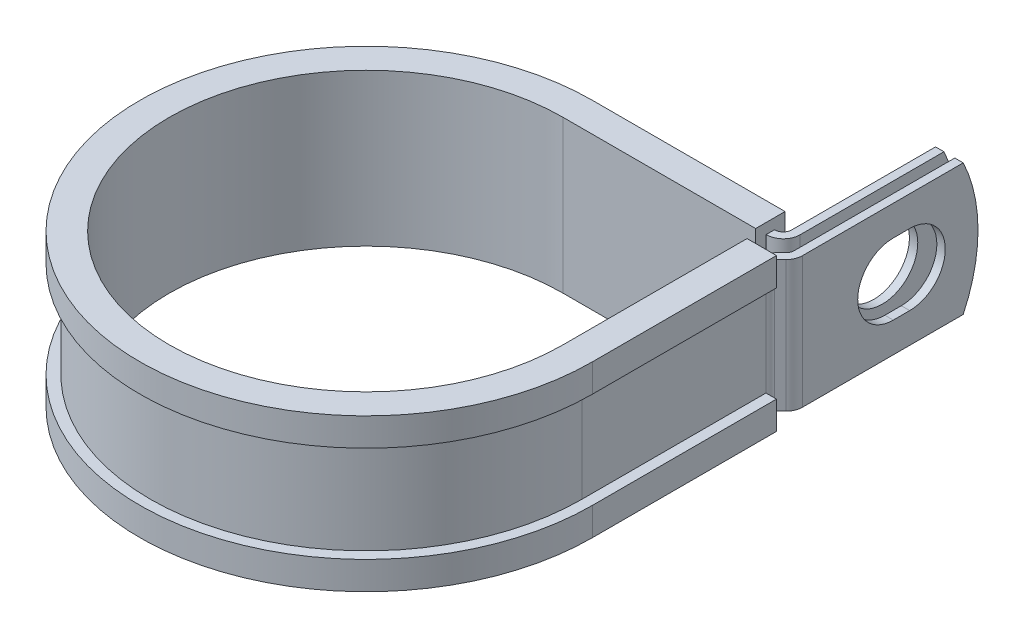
from build123d import *

# Parameters (mm, degrees)
EXTRUDE_THIN1_DEPTH = 9.525
SKETCH2_R           = 5.1562
CUT_EXTRUDE1_DEPTH  = 1.2192
CUT_EXTRUDE2_DEPTH  = 1.2192
CUT_EXTRUDE3_DEPTH  = 83.699802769


with BuildPart() as part:
    # Sketch1 → Extrude-Thin1 (new, symmetric)
    with BuildSketch(Plane(origin=(0, 0, 0), x_dir=(1, 0, 0), z_dir=(0, 1, 0))):
        with BuildLine():
            Line((31.9964698, 55.5498), (31.9964698, 30.099))
            ThreePointArc((31.9964698, 30.099), (31.903663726, 29.632432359), (31.639374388, 29.236895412))
            Line((31.639374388, 29.236895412), (30.813190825, 28.410711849))
            ThreePointArc((30.813190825, 28.410711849), (30.284612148, 27.619637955), (30.099, 26.686502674))
            Line((30.099, 26.686502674), (30.099, 0))
            ThreePointArc((30.099, 0), (-21.283207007, -21.283207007), (0, 30.099))
            Line((0, 30.099), (27.9832698, 30.099))
            ThreePointArc((27.9832698, 30.099), (29.707478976, 30.813190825), (30.4216698, 32.5374))
            Line((30.4216698, 32.5374), (30.4216698, 55.5498))
            Line((30.4216698, 55.5498), (29.2024698, 55.5498))
            Line((29.2024698, 55.5498), (29.2024698, 32.5374))
            ThreePointArc((29.2024698, 32.5374), (28.845374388, 31.675295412), (27.9832698, 31.3182))
            Line((27.9832698, 31.3182), (0, 31.3182))
            ThreePointArc((0, 31.3182), (-22.145311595, -22.145311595), (31.3182, 0))
            Line((31.3182, 0), (31.3182, 26.686502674))
            ThreePointArc((31.3182, 26.686502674), (31.411006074, 27.153070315), (31.675295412, 27.548607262))
            Line((31.675295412, 27.548607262), (32.501478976, 28.374790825))
            ThreePointArc((32.501478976, 28.374790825), (33.030057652, 29.165864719), (33.2156698, 30.099))
            Line((33.2156698, 30.099), (33.2156698, 55.5498))
            Line((33.2156698, 55.5498), (31.9964698, 55.5498))
        make_face()
    extrude(amount=EXTRUDE_THIN1_DEPTH, both=True)

    # Sketch2 → Cut-Extrude1 (cut)
    with BuildSketch(Plane.ZY.offset(-29.2024698)):
        with Locations((-44.45, 0)):
            Circle(SKETCH2_R)
    extrude(amount=-CUT_EXTRUDE1_DEPTH, mode=Mode.SUBTRACT)

    # Sketch3 → Cut-Extrude2 (cut)
    with BuildSketch(Plane(origin=(33.2156698, 0, 0), x_dir=(0, 0, -1), z_dir=(1, 0, 0))):
        with BuildLine():
            Line((43.2562, 5.1562), (45.6438, 5.1562))
            ThreePointArc((45.6438, 5.1562), (50.8, 0), (45.6438, -5.1562))
            Line((45.6438, -5.1562), (43.2562, -5.1562))
            ThreePointArc((43.2562, -5.1562), (38.1, 0), (43.2562, 5.1562))
        make_face()
    extrude(amount=-CUT_EXTRUDE2_DEPTH, mode=Mode.SUBTRACT)

    # Sketch4 → Cut-Extrude3 (cut, through all)
    with BuildSketch(Plane.ZY.offset(-29.2024698)):
        with BuildLine():
            Line((-53.405263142, 9.525), (-55.5498, 9.525))
            Line((-55.5498, 9.525), (-55.5498, -1e-09))
            ThreePointArc((-55.5498, -1e-09), (-55.007038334, 4.881717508), (-53.405263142, 9.525))
        make_face()
        with BuildLine():
            ThreePointArc((-53.405263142, -9.525), (-55.007038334, -4.881717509), (-55.5498, -1e-09))
            Line((-55.5498, -1e-09), (-55.5498, -9.525))
            Line((-55.5498, -9.525), (-53.405263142, -9.525))
        make_face()
    extrude(amount=-CUT_EXTRUDE3_DEPTH, mode=Mode.SUBTRACT)

    # Sweep1: sweep along a path in Sketch6
    with BuildLine(Plane(origin=(0, 9.525, 0), x_dir=(1, 0, 0), z_dir=(0, 1, 0))) as sweep1_path:
        Line((28.575, 26.686502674), (28.575, 0))
        ThreePointArc((28.575, 0), (-20.205576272, -20.205576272), (0, 28.575))
        Line((0, 28.575), (27.9324698, 28.575))
    # Sketch5 → Sweep1 (sweep)
    with BuildSketch(Plane(origin=(0, 0, -26.686502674), x_dir=(-1, 0, 0), z_dir=(0, 0, -1))):
        Polygon((-31.3182, 9.525), (-30.099, 9.525), (-30.099, -9.525), (-31.3182, -9.525), (-31.3182, -6.985), (-32.8422, -6.985), (-32.8422, -11.049), (-28.575, -11.049), (-28.575, 11.049), (-32.8422, 11.049), (-32.8422, 6.985), (-31.3182, 6.985), align=None)
    sweep(path=sweep1_path.line)


solid = part.part
